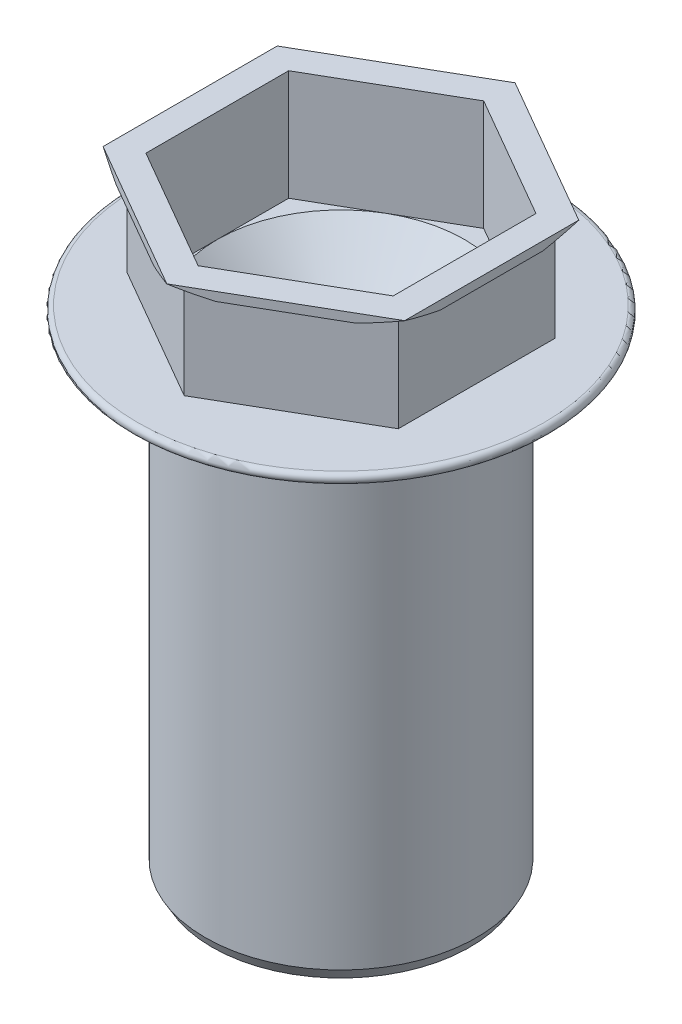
ISO-10303-21;
HEADER;
FILE_DESCRIPTION(('STEP AP214'),'2;1');
FILE_NAME('part.step','',(''),(''),'','','');
FILE_SCHEMA(('AUTOMOTIVE_DESIGN { 1 0 10303 214 1 1 1 1 }'));
ENDSEC;
DATA;
#1=APPLICATION_CONTEXT('core data for automotive mechanical design processes');
#2=APPLICATION_PROTOCOL_DEFINITION('international standard','automotive_design',2000,#1);
#3=PRODUCT_CONTEXT('',#1,'mechanical');
#4=PRODUCT('Part','Part','',(#3));
#5=PRODUCT_RELATED_PRODUCT_CATEGORY('part','',(#4));
#6=PRODUCT_DEFINITION_FORMATION('','',#4);
#7=PRODUCT_DEFINITION_CONTEXT('part definition',#1,'design');
#8=PRODUCT_DEFINITION('design','',#6,#7);
#9=PRODUCT_DEFINITION_SHAPE('','',#8);
#10=(LENGTH_UNIT() NAMED_UNIT(*) SI_UNIT(.MILLI.,.METRE.));
#11=(NAMED_UNIT(*) PLANE_ANGLE_UNIT() SI_UNIT($,.RADIAN.));
#12=(NAMED_UNIT(*) SI_UNIT($,.STERADIAN.) SOLID_ANGLE_UNIT());
#13=UNCERTAINTY_MEASURE_WITH_UNIT(LENGTH_MEASURE(1.E-05),#10,'distance_accuracy_value','');
#14=(GEOMETRIC_REPRESENTATION_CONTEXT(3) GLOBAL_UNCERTAINTY_ASSIGNED_CONTEXT((#13)) GLOBAL_UNIT_ASSIGNED_CONTEXT((#10,
#11,#12)) REPRESENTATION_CONTEXT('',''));
#15=CARTESIAN_POINT('',(0.,0.,0.));
#16=DIRECTION('',(0.,0.,1.));
#17=DIRECTION('',(1.,0.,0.));
#18=AXIS2_PLACEMENT_3D('',#15,#16,#17);
#19=CARTESIAN_POINT('',(0.,6.30000000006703,0.));
#20=DIRECTION('',(0.,1.,0.));
#21=DIRECTION('',(0.,0.,1.));
#22=AXIS2_PLACEMENT_3D('',#19,#20,#21);
#23=CONICAL_SURFACE('',#22,2.45875000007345,1.0471975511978);
#24=CARTESIAN_POINT('',(0.,6.3,0.));
#25=DIRECTION('',(0.,-1.,0.));
#26=DIRECTION('',(1.,0.,0.));
#27=AXIS2_PLACEMENT_3D('',#24,#25,#26);
#28=CIRCLE('',#27,2.45875);
#29=CARTESIAN_POINT('',(2.45875,6.3,0.));
#30=VERTEX_POINT('',#29);
#31=EDGE_CURVE('E244',#30,#30,#28,.F.);
#32=ORIENTED_EDGE('',*,*,#31,.T.);
#33=EDGE_LOOP('',(#32));
#34=FACE_BOUND('',#33,.T.);
#35=CARTESIAN_POINT('',(0.,4.88044002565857,0.));
#36=VERTEX_POINT('',#35);
#37=VERTEX_LOOP('',#36);
#38=FACE_BOUND('',#37,.T.);
#39=ADVANCED_FACE('F16',(#34,#38),#23,.F.);
#40=CARTESIAN_POINT('',(0.,7.079375,0.));
#41=DIRECTION('',(0.,-1.,0.));
#42=DIRECTION('',(1.,0.,0.));
#43=AXIS2_PLACEMENT_3D('',#40,#41,#42);
#44=CYLINDRICAL_SURFACE('',#43,2.45875);
#45=ORIENTED_EDGE('',*,*,#31,.F.);
#46=EDGE_LOOP('',(#45));
#47=FACE_BOUND('',#46,.T.);
#48=CARTESIAN_POINT('',(0.,7.8587499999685,0.));
#49=DIRECTION('',(0.,1.,0.));
#50=DIRECTION('',(1.,0.,0.));
#51=AXIS2_PLACEMENT_3D('',#48,#49,#50);
#52=CIRCLE('',#51,2.45875000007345);
#53=CARTESIAN_POINT('',(2.45875000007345,7.8587499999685,0.));
#54=VERTEX_POINT('',#53);
#55=EDGE_CURVE('E240',#54,#54,#52,.T.);
#56=ORIENTED_EDGE('',*,*,#55,.T.);
#57=EDGE_LOOP('',(#56));
#58=FACE_BOUND('',#57,.T.);
#59=ADVANCED_FACE('F913',(#47,#58),#44,.F.);
#60=CARTESIAN_POINT('',(0.,8.39999999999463,0.));
#61=DIRECTION('',(0.,1.,0.));
#62=DIRECTION('',(0.,0.,1.));
#63=AXIS2_PLACEMENT_3D('',#60,#61,#62);
#64=CONICAL_SURFACE('',#63,3.00000000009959,0.785398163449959);
#65=ORIENTED_EDGE('',*,*,#55,.F.);
#66=EDGE_LOOP('',(#65));
#67=FACE_BOUND('',#66,.T.);
#68=CARTESIAN_POINT('',(0.,8.39999999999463,0.));
#69=DIRECTION('',(0.,1.,0.));
#70=DIRECTION('',(0.,0.,1.));
#71=AXIS2_PLACEMENT_3D('',#68,#69,#70);
#72=CIRCLE('',#71,3.00000000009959);
#73=CARTESIAN_POINT('',(0.,8.39999999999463,3.00000000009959));
#74=VERTEX_POINT('',#73);
#75=EDGE_CURVE('E243',#74,#74,#72,.T.);
#76=ORIENTED_EDGE('',*,*,#75,.T.);
#77=EDGE_LOOP('',(#76));
#78=FACE_BOUND('',#77,.T.);
#79=ADVANCED_FACE('F905',(#67,#78),#64,.F.);
#80=CARTESIAN_POINT('',(2.729375,8.4,0.));
#81=DIRECTION('',(0.,1.,0.));
#82=DIRECTION('',(-1.,0.,0.));
#83=AXIS2_PLACEMENT_3D('',#80,#81,#82);
#84=PLANE('',#83);
#85=CARTESIAN_POINT('',(0.,8.4,0.));
#86=DIRECTION('',(0.,-1.,0.));
#87=DIRECTION('',(1.,0.,0.));
#88=AXIS2_PLACEMENT_3D('',#85,#86,#87);
#89=CIRCLE('',#88,2.45875);
#90=CARTESIAN_POINT('',(2.45875,8.4,0.));
#91=VERTEX_POINT('',#90);
#92=EDGE_CURVE('E239',#91,#91,#89,.F.);
#93=ORIENTED_EDGE('',*,*,#92,.T.);
#94=EDGE_LOOP('',(#93));
#95=FACE_BOUND('',#94,.T.);
#96=ORIENTED_EDGE('',*,*,#75,.F.);
#97=EDGE_LOOP('',(#96));
#98=FACE_BOUND('',#97,.T.);
#99=ADVANCED_FACE('F897',(#95,#98),#84,.F.);
#100=CARTESIAN_POINT('',(0.,14.879375,0.));
#101=DIRECTION('',(0.,-1.,0.));
#102=DIRECTION('',(1.,0.,0.));
#103=AXIS2_PLACEMENT_3D('',#100,#101,#102);
#104=CYLINDRICAL_SURFACE('',#103,2.45875);
#105=ORIENTED_EDGE('',*,*,#92,.F.);
#106=EDGE_LOOP('',(#105));
#107=FACE_BOUND('',#106,.T.);
#108=CARTESIAN_POINT('',(0.,14.5512635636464,0.));
#109=DIRECTION('',(0.,1.,0.));
#110=DIRECTION('',(1.,0.,0.));
#111=AXIS2_PLACEMENT_3D('',#108,#109,#110);
#112=CIRCLE('',#111,2.45874999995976);
#113=CARTESIAN_POINT('',(2.45874999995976,14.5512635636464,0.));
#114=VERTEX_POINT('',#113);
#115=EDGE_CURVE('E216',#114,#114,#112,.T.);
#116=ORIENTED_EDGE('',*,*,#115,.T.);
#117=EDGE_LOOP('',(#116));
#118=FACE_BOUND('',#117,.T.);
#119=ADVANCED_FACE('F889',(#107,#118),#104,.F.);
#120=CARTESIAN_POINT('',(0.,16.1375000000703,0.));
#121=DIRECTION('',(0.,1.,0.));
#122=DIRECTION('',(0.,0.,1.));
#123=AXIS2_PLACEMENT_3D('',#120,#121,#122);
#124=CONICAL_SURFACE('',#123,4.10000000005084,0.802441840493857);
#125=ORIENTED_EDGE('',*,*,#115,.F.);
#126=EDGE_LOOP('',(#125));
#127=FACE_BOUND('',#126,.T.);
#128=CARTESIAN_POINT('',(0.,16.1375000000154,0.));
#129=DIRECTION('',(0.,1.,0.));
#130=DIRECTION('',(0.,0.,1.));
#131=AXIS2_PLACEMENT_3D('',#128,#129,#130);
#132=CIRCLE('',#131,4.099999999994);
#133=CARTESIAN_POINT('',(-4.10000000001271,16.1375000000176,0.));
#134=VERTEX_POINT('',#133);
#135=CARTESIAN_POINT('',(-2.0499999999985,16.1375000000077,-3.5507041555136));
#136=VERTEX_POINT('',#135);
#137=EDGE_CURVE('E189',#134,#136,#132,.F.);
#138=ORIENTED_EDGE('',*,*,#137,.F.);
#139=CARTESIAN_POINT('',(0.,16.1375000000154,0.));
#140=DIRECTION('',(0.,1.,0.));
#141=DIRECTION('',(0.,0.,1.));
#142=AXIS2_PLACEMENT_3D('',#139,#140,#141);
#143=CIRCLE('',#142,4.099999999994);
#144=CARTESIAN_POINT('',(-2.0499999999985,16.1375000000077,3.5507041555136));
#145=VERTEX_POINT('',#144);
#146=EDGE_CURVE('E317',#145,#134,#143,.F.);
#147=ORIENTED_EDGE('',*,*,#146,.F.);
#148=CARTESIAN_POINT('',(0.,16.1375000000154,0.));
#149=DIRECTION('',(0.,1.,0.));
#150=DIRECTION('',(0.,0.,1.));
#151=AXIS2_PLACEMENT_3D('',#148,#149,#150);
#152=CIRCLE('',#151,4.099999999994);
#153=CARTESIAN_POINT('',(2.0499999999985,16.1375000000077,3.5507041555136));
#154=VERTEX_POINT('',#153);
#155=EDGE_CURVE('E232',#154,#145,#152,.F.);
#156=ORIENTED_EDGE('',*,*,#155,.F.);
#157=CARTESIAN_POINT('',(0.,16.1375000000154,0.));
#158=DIRECTION('',(0.,1.,0.));
#159=DIRECTION('',(0.,0.,1.));
#160=AXIS2_PLACEMENT_3D('',#157,#158,#159);
#161=CIRCLE('',#160,4.099999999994);
#162=CARTESIAN_POINT('',(4.10000000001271,16.1375000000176,0.));
#163=VERTEX_POINT('',#162);
#164=EDGE_CURVE('E319',#163,#154,#161,.F.);
#165=ORIENTED_EDGE('',*,*,#164,.F.);
#166=CARTESIAN_POINT('',(0.,16.1375000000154,0.));
#167=DIRECTION('',(0.,1.,0.));
#168=DIRECTION('',(0.,0.,1.));
#169=AXIS2_PLACEMENT_3D('',#166,#167,#168);
#170=CIRCLE('',#169,4.099999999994);
#171=CARTESIAN_POINT('',(2.0499999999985,16.1375000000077,-3.5507041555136));
#172=VERTEX_POINT('',#171);
#173=EDGE_CURVE('E196',#172,#163,#170,.F.);
#174=ORIENTED_EDGE('',*,*,#173,.F.);
#175=CARTESIAN_POINT('',(0.,16.1375000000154,0.));
#176=DIRECTION('',(0.,1.,0.));
#177=DIRECTION('',(0.,0.,1.));
#178=AXIS2_PLACEMENT_3D('',#175,#176,#177);
#179=CIRCLE('',#178,4.099999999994);
#180=EDGE_CURVE('E192',#136,#172,#179,.F.);
#181=ORIENTED_EDGE('',*,*,#180,.F.);
#182=EDGE_LOOP('',(#138,#147,#156,#165,#174,#181));
#183=FACE_BOUND('',#182,.T.);
#184=ADVANCED_FACE('F194',(#127,#183),#124,.F.);
#185=CARTESIAN_POINT('',(0.,16.1375,0.));
#186=DIRECTION('',(0.,1.,0.));
#187=DIRECTION('',(0.,0.,1.));
#188=AXIS2_PLACEMENT_3D('',#185,#186,#187);
#189=PLANE('',#188);
#190=DIRECTION('',(-0.866025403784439,0.,0.5));
#191=VECTOR('',#190,1.);
#192=CARTESIAN_POINT('',(-2.05,16.1375,-3.5507041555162));
#193=LINE('',#192,#191);
#194=CARTESIAN_POINT('',(-4.1,16.1375,-2.36713610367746));
#195=VERTEX_POINT('',#194);
#196=EDGE_CURVE('E208',#136,#195,#193,.T.);
#197=ORIENTED_EDGE('',*,*,#196,.T.);
#198=DIRECTION('',(0.,0.,1.));
#199=VECTOR('',#198,1.);
#200=CARTESIAN_POINT('',(-4.1,16.1375,0.));
#201=LINE('',#200,#199);
#202=EDGE_CURVE('E214',#195,#134,#201,.T.);
#203=ORIENTED_EDGE('',*,*,#202,.T.);
#204=ORIENTED_EDGE('',*,*,#137,.T.);
#205=EDGE_LOOP('',(#197,#203,#204));
#206=FACE_BOUND('',#205,.T.);
#207=ADVANCED_FACE('F212',(#206),#189,.T.);
#208=CARTESIAN_POINT('',(0.,16.1375,0.));
#209=DIRECTION('',(0.,1.,0.));
#210=DIRECTION('',(0.,0.,1.));
#211=AXIS2_PLACEMENT_3D('',#208,#209,#210);
#212=PLANE('',#211);
#213=DIRECTION('',(-0.866025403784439,0.,-0.5));
#214=VECTOR('',#213,1.);
#215=CARTESIAN_POINT('',(2.05,16.1375,-3.5507041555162));
#216=LINE('',#215,#214);
#217=CARTESIAN_POINT('',(0.,16.1375,-4.73427220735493));
#218=VERTEX_POINT('',#217);
#219=EDGE_CURVE('E204',#172,#218,#216,.T.);
#220=ORIENTED_EDGE('',*,*,#219,.T.);
#221=DIRECTION('',(-0.866025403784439,0.,0.5));
#222=VECTOR('',#221,1.);
#223=CARTESIAN_POINT('',(-2.05,16.1375,-3.5507041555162));
#224=LINE('',#223,#222);
#225=EDGE_CURVE('E202',#218,#136,#224,.T.);
#226=ORIENTED_EDGE('',*,*,#225,.T.);
#227=ORIENTED_EDGE('',*,*,#180,.T.);
#228=EDGE_LOOP('',(#220,#226,#227));
#229=FACE_BOUND('',#228,.T.);
#230=ADVANCED_FACE('F203',(#229),#212,.T.);
#231=CARTESIAN_POINT('',(0.,16.1375,0.));
#232=DIRECTION('',(0.,1.,0.));
#233=DIRECTION('',(0.,0.,1.));
#234=AXIS2_PLACEMENT_3D('',#231,#232,#233);
#235=PLANE('',#234);
#236=DIRECTION('',(0.,0.,-1.));
#237=VECTOR('',#236,1.);
#238=CARTESIAN_POINT('',(4.1,16.1375,0.));
#239=LINE('',#238,#237);
#240=CARTESIAN_POINT('',(4.1,16.1375,-2.36713610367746));
#241=VERTEX_POINT('',#240);
#242=EDGE_CURVE('E565',#163,#241,#239,.T.);
#243=ORIENTED_EDGE('',*,*,#242,.T.);
#244=DIRECTION('',(-0.866025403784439,0.,-0.5));
#245=VECTOR('',#244,1.);
#246=CARTESIAN_POINT('',(2.05,16.1375,-3.5507041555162));
#247=LINE('',#246,#245);
#248=EDGE_CURVE('E223',#241,#172,#247,.T.);
#249=ORIENTED_EDGE('',*,*,#248,.T.);
#250=ORIENTED_EDGE('',*,*,#173,.T.);
#251=EDGE_LOOP('',(#243,#249,#250));
#252=FACE_BOUND('',#251,.T.);
#253=ADVANCED_FACE('F615',(#252),#235,.T.);
#254=CARTESIAN_POINT('',(0.,16.1375,0.));
#255=DIRECTION('',(0.,1.,0.));
#256=DIRECTION('',(0.,0.,1.));
#257=AXIS2_PLACEMENT_3D('',#254,#255,#256);
#258=PLANE('',#257);
#259=DIRECTION('',(0.866025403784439,0.,-0.5));
#260=VECTOR('',#259,1.);
#261=CARTESIAN_POINT('',(2.05,16.1375,3.5507041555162));
#262=LINE('',#261,#260);
#263=CARTESIAN_POINT('',(4.1,16.1375,2.36713610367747));
#264=VERTEX_POINT('',#263);
#265=EDGE_CURVE('E536',#154,#264,#262,.T.);
#266=ORIENTED_EDGE('',*,*,#265,.T.);
#267=DIRECTION('',(0.,0.,-1.));
#268=VECTOR('',#267,1.);
#269=CARTESIAN_POINT('',(4.1,16.1375,0.));
#270=LINE('',#269,#268);
#271=EDGE_CURVE('E562',#264,#163,#270,.T.);
#272=ORIENTED_EDGE('',*,*,#271,.T.);
#273=ORIENTED_EDGE('',*,*,#164,.T.);
#274=EDGE_LOOP('',(#266,#272,#273));
#275=FACE_BOUND('',#274,.T.);
#276=ADVANCED_FACE('F610',(#275),#258,.T.);
#277=CARTESIAN_POINT('',(0.,16.1375,0.));
#278=DIRECTION('',(0.,1.,0.));
#279=DIRECTION('',(0.,0.,1.));
#280=AXIS2_PLACEMENT_3D('',#277,#278,#279);
#281=PLANE('',#280);
#282=DIRECTION('',(0.,0.,1.));
#283=VECTOR('',#282,1.);
#284=CARTESIAN_POINT('',(-4.1,16.1375,0.));
#285=LINE('',#284,#283);
#286=CARTESIAN_POINT('',(-4.1,16.1375,2.36713610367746));
#287=VERTEX_POINT('',#286);
#288=EDGE_CURVE('E209',#134,#287,#285,.T.);
#289=ORIENTED_EDGE('',*,*,#288,.T.);
#290=DIRECTION('',(0.866025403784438,0.,0.5));
#291=VECTOR('',#290,1.);
#292=CARTESIAN_POINT('',(-2.05,16.1375,3.5507041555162));
#293=LINE('',#292,#291);
#294=EDGE_CURVE('E522',#287,#145,#293,.T.);
#295=ORIENTED_EDGE('',*,*,#294,.T.);
#296=ORIENTED_EDGE('',*,*,#146,.T.);
#297=EDGE_LOOP('',(#289,#295,#296));
#298=FACE_BOUND('',#297,.T.);
#299=ADVANCED_FACE('F603',(#298),#281,.T.);
#300=CARTESIAN_POINT('',(0.,16.1375,0.));
#301=DIRECTION('',(0.,1.,0.));
#302=DIRECTION('',(0.,0.,1.));
#303=AXIS2_PLACEMENT_3D('',#300,#301,#302);
#304=PLANE('',#303);
#305=DIRECTION('',(0.866025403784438,0.,0.5));
#306=VECTOR('',#305,1.);
#307=CARTESIAN_POINT('',(-2.05,16.1375,3.5507041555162));
#308=LINE('',#307,#306);
#309=CARTESIAN_POINT('',(0.,16.1375,4.73427220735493));
#310=VERTEX_POINT('',#309);
#311=EDGE_CURVE('E525',#145,#310,#308,.T.);
#312=ORIENTED_EDGE('',*,*,#311,.T.);
#313=DIRECTION('',(0.866025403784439,0.,-0.5));
#314=VECTOR('',#313,1.);
#315=CARTESIAN_POINT('',(2.05,16.1375,3.5507041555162));
#316=LINE('',#315,#314);
#317=EDGE_CURVE('E533',#310,#154,#316,.T.);
#318=ORIENTED_EDGE('',*,*,#317,.T.);
#319=ORIENTED_EDGE('',*,*,#155,.T.);
#320=EDGE_LOOP('',(#312,#318,#319));
#321=FACE_BOUND('',#320,.T.);
#322=ADVANCED_FACE('F605',(#321),#304,.T.);
#323=CARTESIAN_POINT('',(-4.1,20.8,0.));
#324=DIRECTION('',(-1.,0.,0.));
#325=DIRECTION('',(0.,0.,1.));
#326=AXIS2_PLACEMENT_3D('',#323,#324,#325);
#327=PLANE('',#326);
#328=DIRECTION('',(0.,1.,0.));
#329=VECTOR('',#328,1.);
#330=CARTESIAN_POINT('',(-4.1,20.8,2.36713610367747));
#331=LINE('',#330,#329);
#332=CARTESIAN_POINT('',(-4.1,19.8,2.36713610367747));
#333=VERTEX_POINT('',#332);
#334=EDGE_CURVE('E526',#333,#287,#331,.F.);
#335=ORIENTED_EDGE('',*,*,#334,.T.);
#336=ORIENTED_EDGE('',*,*,#288,.F.);
#337=ORIENTED_EDGE('',*,*,#202,.F.);
#338=DIRECTION('',(0.,1.,0.));
#339=VECTOR('',#338,1.);
#340=CARTESIAN_POINT('',(-4.1,20.8,-2.36713610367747));
#341=LINE('',#340,#339);
#342=CARTESIAN_POINT('',(-4.1,19.8,-2.36713610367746));
#343=VERTEX_POINT('',#342);
#344=EDGE_CURVE('E221',#195,#343,#341,.T.);
#345=ORIENTED_EDGE('',*,*,#344,.T.);
#346=DIRECTION('',(0.,0.,1.));
#347=VECTOR('',#346,1.);
#348=CARTESIAN_POINT('',(-4.1,19.8,0.));
#349=LINE('',#348,#347);
#350=EDGE_CURVE('E504',#333,#343,#349,.F.);
#351=ORIENTED_EDGE('',*,*,#350,.F.);
#352=EDGE_LOOP('',(#335,#336,#337,#345,#351));
#353=FACE_BOUND('',#352,.T.);
#354=ADVANCED_FACE('F595',(#353),#327,.F.);
#355=CARTESIAN_POINT('',(-2.05,20.8,-3.5507041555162));
#356=DIRECTION('',(-0.5,0.,-0.866025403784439));
#357=DIRECTION('',(-0.866025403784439,0.,0.5));
#358=AXIS2_PLACEMENT_3D('',#355,#356,#357);
#359=PLANE('',#358);
#360=ORIENTED_EDGE('',*,*,#344,.F.);
#361=ORIENTED_EDGE('',*,*,#196,.F.);
#362=ORIENTED_EDGE('',*,*,#225,.F.);
#363=DIRECTION('',(0.,1.,0.));
#364=VECTOR('',#363,1.);
#365=CARTESIAN_POINT('',(0.,20.8,-4.73427220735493));
#366=LINE('',#365,#364);
#367=CARTESIAN_POINT('',(0.,19.8,-4.73427220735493));
#368=VERTEX_POINT('',#367);
#369=EDGE_CURVE('E566',#218,#368,#366,.T.);
#370=ORIENTED_EDGE('',*,*,#369,.T.);
#371=DIRECTION('',(0.866025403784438,0.,-0.500000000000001));
#372=VECTOR('',#371,1.);
#373=CARTESIAN_POINT('',(-4.1,19.8,-2.36713610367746));
#374=LINE('',#373,#372);
#375=EDGE_CURVE('E501',#343,#368,#374,.T.);
#376=ORIENTED_EDGE('',*,*,#375,.F.);
#377=EDGE_LOOP('',(#360,#361,#362,#370,#376));
#378=FACE_BOUND('',#377,.T.);
#379=ADVANCED_FACE('F219',(#378),#359,.F.);
#380=CARTESIAN_POINT('',(2.05,20.8,-3.5507041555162));
#381=DIRECTION('',(0.5,0.,-0.866025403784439));
#382=DIRECTION('',(-0.866025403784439,0.,-0.5));
#383=AXIS2_PLACEMENT_3D('',#380,#381,#382);
#384=PLANE('',#383);
#385=ORIENTED_EDGE('',*,*,#369,.F.);
#386=ORIENTED_EDGE('',*,*,#219,.F.);
#387=ORIENTED_EDGE('',*,*,#248,.F.);
#388=DIRECTION('',(0.,1.,0.));
#389=VECTOR('',#388,1.);
#390=CARTESIAN_POINT('',(4.1,20.8,-2.36713610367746));
#391=LINE('',#390,#389);
#392=CARTESIAN_POINT('',(4.1,19.8,-2.36713610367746));
#393=VERTEX_POINT('',#392);
#394=EDGE_CURVE('E537',#241,#393,#391,.T.);
#395=ORIENTED_EDGE('',*,*,#394,.T.);
#396=DIRECTION('',(0.866025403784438,0.,0.500000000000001));
#397=VECTOR('',#396,1.);
#398=CARTESIAN_POINT('',(0.,19.8,-4.73427220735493));
#399=LINE('',#398,#397);
#400=EDGE_CURVE('E498',#368,#393,#399,.T.);
#401=ORIENTED_EDGE('',*,*,#400,.F.);
#402=EDGE_LOOP('',(#385,#386,#387,#395,#401));
#403=FACE_BOUND('',#402,.T.);
#404=ADVANCED_FACE('F587',(#403),#384,.F.);
#405=CARTESIAN_POINT('',(4.1,20.8,0.));
#406=DIRECTION('',(1.,0.,0.));
#407=DIRECTION('',(0.,0.,-1.));
#408=AXIS2_PLACEMENT_3D('',#405,#406,#407);
#409=PLANE('',#408);
#410=ORIENTED_EDGE('',*,*,#394,.F.);
#411=ORIENTED_EDGE('',*,*,#242,.F.);
#412=ORIENTED_EDGE('',*,*,#271,.F.);
#413=DIRECTION('',(0.,1.,0.));
#414=VECTOR('',#413,1.);
#415=CARTESIAN_POINT('',(4.1,20.8,2.36713610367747));
#416=LINE('',#415,#414);
#417=CARTESIAN_POINT('',(4.1,19.8,2.36713610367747));
#418=VERTEX_POINT('',#417);
#419=EDGE_CURVE('E545',#264,#418,#416,.T.);
#420=ORIENTED_EDGE('',*,*,#419,.T.);
#421=DIRECTION('',(0.,0.,1.));
#422=VECTOR('',#421,1.);
#423=CARTESIAN_POINT('',(4.1,19.8,0.));
#424=LINE('',#423,#422);
#425=EDGE_CURVE('E495',#393,#418,#424,.T.);
#426=ORIENTED_EDGE('',*,*,#425,.F.);
#427=EDGE_LOOP('',(#410,#411,#412,#420,#426));
#428=FACE_BOUND('',#427,.T.);
#429=ADVANCED_FACE('F616',(#428),#409,.F.);
#430=CARTESIAN_POINT('',(2.05,20.8,3.5507041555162));
#431=DIRECTION('',(0.5,0.,0.866025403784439));
#432=DIRECTION('',(0.866025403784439,0.,-0.5));
#433=AXIS2_PLACEMENT_3D('',#430,#431,#432);
#434=PLANE('',#433);
#435=ORIENTED_EDGE('',*,*,#419,.F.);
#436=ORIENTED_EDGE('',*,*,#265,.F.);
#437=ORIENTED_EDGE('',*,*,#317,.F.);
#438=DIRECTION('',(0.,1.,0.));
#439=VECTOR('',#438,1.);
#440=CARTESIAN_POINT('',(0.,20.8,4.73427220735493));
#441=LINE('',#440,#439);
#442=CARTESIAN_POINT('',(0.,19.8,4.73427220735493));
#443=VERTEX_POINT('',#442);
#444=EDGE_CURVE('E530',#310,#443,#441,.T.);
#445=ORIENTED_EDGE('',*,*,#444,.T.);
#446=DIRECTION('',(-0.866025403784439,0.,0.499999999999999));
#447=VECTOR('',#446,1.);
#448=CARTESIAN_POINT('',(4.1,19.8,2.36713610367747));
#449=LINE('',#448,#447);
#450=EDGE_CURVE('E491',#418,#443,#449,.T.);
#451=ORIENTED_EDGE('',*,*,#450,.F.);
#452=EDGE_LOOP('',(#435,#436,#437,#445,#451));
#453=FACE_BOUND('',#452,.T.);
#454=ADVANCED_FACE('F619',(#453),#434,.F.);
#455=CARTESIAN_POINT('',(-2.05,20.8,3.5507041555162));
#456=DIRECTION('',(-0.5,0.,0.866025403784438));
#457=DIRECTION('',(0.866025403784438,0.,0.5));
#458=AXIS2_PLACEMENT_3D('',#455,#456,#457);
#459=PLANE('',#458);
#460=ORIENTED_EDGE('',*,*,#444,.F.);
#461=ORIENTED_EDGE('',*,*,#311,.F.);
#462=ORIENTED_EDGE('',*,*,#294,.F.);
#463=ORIENTED_EDGE('',*,*,#334,.F.);
#464=DIRECTION('',(-0.866025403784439,0.,-0.499999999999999));
#465=VECTOR('',#464,1.);
#466=CARTESIAN_POINT('',(0.,19.8,4.73427220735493));
#467=LINE('',#466,#465);
#468=EDGE_CURVE('E494',#443,#333,#467,.T.);
#469=ORIENTED_EDGE('',*,*,#468,.F.);
#470=EDGE_LOOP('',(#460,#461,#462,#463,#469));
#471=FACE_BOUND('',#470,.T.);
#472=ADVANCED_FACE('F600',(#471),#459,.F.);
#473=CARTESIAN_POINT('',(2.89,19.8,0.));
#474=DIRECTION('',(0.,1.,0.));
#475=DIRECTION('',(0.,0.,1.));
#476=AXIS2_PLACEMENT_3D('',#473,#474,#475);
#477=PLANE('',#476);
#478=DIRECTION('',(0.866025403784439,0.,-0.5));
#479=VECTOR('',#478,1.);
#480=CARTESIAN_POINT('',(2.5,19.8,4.3301270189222));
#481=LINE('',#480,#479);
#482=CARTESIAN_POINT('',(5.,19.8,2.88675134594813));
#483=VERTEX_POINT('',#482);
#484=CARTESIAN_POINT('',(0.,19.8,5.77350269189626));
#485=VERTEX_POINT('',#484);
#486=EDGE_CURVE('E472',#483,#485,#481,.F.);
#487=ORIENTED_EDGE('',*,*,#486,.F.);
#488=DIRECTION('',(0.,0.,-1.));
#489=VECTOR('',#488,1.);
#490=CARTESIAN_POINT('',(5.,19.8,0.));
#491=LINE('',#490,#489);
#492=CARTESIAN_POINT('',(5.,19.8,-2.88675134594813));
#493=VERTEX_POINT('',#492);
#494=EDGE_CURVE('E465',#493,#483,#491,.F.);
#495=ORIENTED_EDGE('',*,*,#494,.F.);
#496=DIRECTION('',(-0.866025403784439,0.,-0.5));
#497=VECTOR('',#496,1.);
#498=CARTESIAN_POINT('',(2.5,19.8,-4.33012701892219));
#499=LINE('',#498,#497);
#500=CARTESIAN_POINT('',(0.,19.8,-5.77350269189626));
#501=VERTEX_POINT('',#500);
#502=EDGE_CURVE('E458',#501,#493,#499,.F.);
#503=ORIENTED_EDGE('',*,*,#502,.F.);
#504=DIRECTION('',(-0.866025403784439,0.,0.5));
#505=VECTOR('',#504,1.);
#506=CARTESIAN_POINT('',(-2.5,19.8,-4.33012701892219));
#507=LINE('',#506,#505);
#508=CARTESIAN_POINT('',(-5.,19.8,-2.88675134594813));
#509=VERTEX_POINT('',#508);
#510=EDGE_CURVE('E447',#509,#501,#507,.F.);
#511=ORIENTED_EDGE('',*,*,#510,.F.);
#512=DIRECTION('',(0.,0.,1.));
#513=VECTOR('',#512,1.);
#514=CARTESIAN_POINT('',(-5.,19.8,0.));
#515=LINE('',#514,#513);
#516=CARTESIAN_POINT('',(-5.,19.8,2.88675134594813));
#517=VERTEX_POINT('',#516);
#518=EDGE_CURVE('E310',#517,#509,#515,.F.);
#519=ORIENTED_EDGE('',*,*,#518,.F.);
#520=DIRECTION('',(0.866025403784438,0.,0.5));
#521=VECTOR('',#520,1.);
#522=CARTESIAN_POINT('',(-2.5,19.8,4.33012701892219));
#523=LINE('',#522,#521);
#524=EDGE_CURVE('E479',#485,#517,#523,.F.);
#525=ORIENTED_EDGE('',*,*,#524,.F.);
#526=EDGE_LOOP('',(#487,#495,#503,#511,#519,#525));
#527=FACE_BOUND('',#526,.T.);
#528=ORIENTED_EDGE('',*,*,#450,.T.);
#529=ORIENTED_EDGE('',*,*,#468,.T.);
#530=ORIENTED_EDGE('',*,*,#350,.T.);
#531=ORIENTED_EDGE('',*,*,#375,.T.);
#532=ORIENTED_EDGE('',*,*,#400,.T.);
#533=ORIENTED_EDGE('',*,*,#425,.T.);
#534=EDGE_LOOP('',(#528,#529,#530,#531,#532,#533));
#535=FACE_BOUND('',#534,.T.);
#536=ADVANCED_FACE('F295',(#527,#535),#477,.T.);
#537=CARTESIAN_POINT('',(0.,19.7979583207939,0.));
#538=DIRECTION('',(0.,1.,0.));
#539=DIRECTION('',(0.,0.,1.));
#540=AXIS2_PLACEMENT_3D('',#537,#538,#539);
#541=CONICAL_SURFACE('',#540,5.77646370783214,1.04719755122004);
#542=CARTESIAN_POINT('',(-5.00000000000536,19.7962487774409,-2.88675134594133));
#543=CARTESIAN_POINT('',(-5.00000000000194,19.767947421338,-2.78870748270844));
#544=CARTESIAN_POINT('',(-5.00000000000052,19.7406402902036,-2.6903717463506));
#545=CARTESIAN_POINT('',(-4.99999999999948,19.6882450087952,-2.49317433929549));
#546=CARTESIAN_POINT('',(-4.99999999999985,19.6631555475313,-2.39431301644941));
#547=CARTESIAN_POINT('',(-5.00000000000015,19.6153900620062,-2.1959977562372));
#548=CARTESIAN_POINT('',(-5.00000000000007,19.5927142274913,-2.09654377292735));
#549=CARTESIAN_POINT('',(-4.99999999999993,19.5499886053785,-1.89701233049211));
#550=CARTESIAN_POINT('',(-4.99999999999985,19.5299403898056,-1.79693453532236));
#551=CARTESIAN_POINT('',(-5.,19.5113248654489,-1.69658480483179));
#552=B_SPLINE_CURVE_WITH_KNOTS('',3,(#542,#543,#544,#545,#546,#547,#548,#549,#550,#551),
.UNSPECIFIED.,.F.,.F.,(4,2,2,2,4),(0.,0.306142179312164,0.612102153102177,0.918086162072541,
1.22425240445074),.UNSPECIFIED.);
#553=CARTESIAN_POINT('',(-5.,19.7962487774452,-2.88675134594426));
#554=VERTEX_POINT('',#553);
#555=CARTESIAN_POINT('',(-5.,19.5113248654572,-1.69658480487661));
#556=VERTEX_POINT('',#555);
#557=EDGE_CURVE('E302',#554,#556,#552,.T.);
#558=ORIENTED_EDGE('',*,*,#557,.F.);
#559=CARTESIAN_POINT('',(-3.969285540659,19.5113248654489,-3.48183461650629));
#560=CARTESIAN_POINT('',(-4.0561909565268,19.5299403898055,-3.43165975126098));
#561=CARTESIAN_POINT('',(-4.14286086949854,19.5499886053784,-3.38162085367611));
#562=CARTESIAN_POINT('',(-4.31566016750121,19.5927142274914,-3.28185513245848));
#563=CARTESIAN_POINT('',(-4.40178984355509,19.6153900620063,-3.23212814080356));
#564=CARTESIAN_POINT('',(-4.57353589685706,19.6631555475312,-3.13297051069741));
#565=CARTESIAN_POINT('',(-4.65915231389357,19.6882450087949,-3.08353984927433));
#566=CARTESIAN_POINT('',(-4.82993027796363,19.740640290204,-2.98494114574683));
#567=CARTESIAN_POINT('',(-4.9150915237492,19.7679474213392,-2.93577327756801));
#568=CARTESIAN_POINT('',(-4.99999999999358,19.7962487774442,-2.88675134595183));
#569=B_SPLINE_CURVE_WITH_KNOTS('',3,(#559,#560,#561,#562,#563,#564,#565,#566,#567,#568),
.UNSPECIFIED.,.F.,.F.,(4,2,2,2,4),(0.,0.306166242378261,0.612150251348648,0.918110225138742,
1.22425240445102),.UNSPECIFIED.);
#570=CARTESIAN_POINT('',(-3.96928554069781,19.5113248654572,-3.48183461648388));
#571=VERTEX_POINT('',#570);
#572=EDGE_CURVE('E271',#571,#554,#569,.T.);
#573=ORIENTED_EDGE('',*,*,#572,.F.);
#574=CARTESIAN_POINT('',(0.,19.5113248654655,0.));
#575=DIRECTION('',(0.,1.,0.));
#576=DIRECTION('',(0.,0.,1.));
#577=AXIS2_PLACEMENT_3D('',#574,#575,#576);
#578=CIRCLE('',#577,5.28000000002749);
#579=EDGE_CURVE('E268',#571,#556,#578,.T.);
#580=ORIENTED_EDGE('',*,*,#579,.T.);
#581=EDGE_LOOP('',(#558,#573,#580));
#582=FACE_BOUND('',#581,.T.);
#583=ADVANCED_FACE('F289',(#582),#541,.T.);
#584=CARTESIAN_POINT('',(-5.,19.5113248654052,0.));
#585=DIRECTION('',(-1.,0.,0.));
#586=DIRECTION('',(0.,0.,1.));
#587=AXIS2_PLACEMENT_3D('',#584,#585,#586);
#588=PLANE('',#587);
#589=ORIENTED_EDGE('',*,*,#557,.T.);
#590=DIRECTION('',(0.,0.,1.));
#591=VECTOR('',#590,1.);
#592=CARTESIAN_POINT('',(-5.,19.5113248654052,0.));
#593=LINE('',#592,#591);
#594=CARTESIAN_POINT('',(-5.,19.5113248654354,1.69658480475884));
#595=VERTEX_POINT('',#594);
#596=EDGE_CURVE('E267',#556,#595,#593,.T.);
#597=ORIENTED_EDGE('',*,*,#596,.T.);
#598=CARTESIAN_POINT('',(-5.00000000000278,19.7962487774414,2.88675134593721));
#599=CARTESIAN_POINT('',(-5.000000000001,19.7679474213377,2.78870748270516));
#600=CARTESIAN_POINT('',(-5.00000000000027,19.7406402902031,2.69037174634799));
#601=CARTESIAN_POINT('',(-4.99999999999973,19.6882450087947,2.49317433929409));
#602=CARTESIAN_POINT('',(-4.99999999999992,19.663155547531,2.39431301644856));
#603=CARTESIAN_POINT('',(-5.00000000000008,19.6153900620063,2.19599775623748));
#604=CARTESIAN_POINT('',(-5.00000000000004,19.5927142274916,2.09654377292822));
#605=CARTESIAN_POINT('',(-4.99999999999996,19.5499886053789,1.89701233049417));
#606=CARTESIAN_POINT('',(-4.99999999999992,19.529940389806,1.79693453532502));
#607=CARTESIAN_POINT('',(-5.,19.5113248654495,1.69658480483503));
#608=B_SPLINE_CURVE_WITH_KNOTS('',3,(#598,#599,#600,#601,#602,#603,#604,#605,#606,#607),
.UNSPECIFIED.,.F.,.F.,(4,2,2,2,4),(0.,0.306142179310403,0.612102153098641,0.918086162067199,
1.22425240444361),.UNSPECIFIED.);
#609=CARTESIAN_POINT('',(-4.99999999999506,19.796248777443,2.88675134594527));
#610=VERTEX_POINT('',#609);
#611=EDGE_CURVE('E309',#610,#595,#608,.T.);
#612=ORIENTED_EDGE('',*,*,#611,.F.);
#613=DIRECTION('',(0.,1.,0.));
#614=VECTOR('',#613,1.);
#615=CARTESIAN_POINT('',(-5.,19.5113248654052,2.88675134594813));
#616=LINE('',#615,#614);
#617=EDGE_CURVE('E475',#517,#610,#616,.F.);
#618=ORIENTED_EDGE('',*,*,#617,.F.);
#619=ORIENTED_EDGE('',*,*,#518,.T.);
#620=DIRECTION('',(0.,1.,0.));
#621=VECTOR('',#620,1.);
#622=CARTESIAN_POINT('',(-5.,19.5113248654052,-2.88675134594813));
#623=LINE('',#622,#621);
#624=EDGE_CURVE('E279',#554,#509,#623,.T.);
#625=ORIENTED_EDGE('',*,*,#624,.F.);
#626=EDGE_LOOP('',(#589,#597,#612,#618,#619,#625));
#627=FACE_BOUND('',#626,.T.);
#628=ADVANCED_FACE('F294',(#627),#588,.T.);
#629=CARTESIAN_POINT('',(0.,19.7979583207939,0.));
#630=DIRECTION('',(0.,1.,0.));
#631=DIRECTION('',(0.,0.,1.));
#632=AXIS2_PLACEMENT_3D('',#629,#630,#631);
#633=CONICAL_SURFACE('',#632,5.77646370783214,1.04719755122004);
#634=CARTESIAN_POINT('',(-4.99999999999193,19.7962487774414,2.886751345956));
#635=CARTESIAN_POINT('',(-4.9150915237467,19.7679474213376,2.93577327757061));
#636=CARTESIAN_POINT('',(-4.82993027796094,19.7406402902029,2.98494114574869));
#637=CARTESIAN_POINT('',(-4.65915231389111,19.6882450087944,3.08353984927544));
#638=CARTESIAN_POINT('',(-4.57353589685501,19.6631555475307,3.13297051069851));
#639=CARTESIAN_POINT('',(-4.40178984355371,19.6153900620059,3.23212814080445));
#640=CARTESIAN_POINT('',(-4.31566016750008,19.5927142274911,3.28185513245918));
#641=CARTESIAN_POINT('',(-4.14286086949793,19.5499886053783,3.38162085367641));
#642=CARTESIAN_POINT('',(-4.05619095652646,19.5299403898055,3.43165975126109));
#643=CARTESIAN_POINT('',(-3.969285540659,19.5113248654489,3.48183461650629));
#644=B_SPLINE_CURVE_WITH_KNOTS('',3,(#634,#635,#636,#637,#638,#639,#640,#641,#642,#643),
.UNSPECIFIED.,.F.,.F.,(4,2,2,2,4),(0.,0.306142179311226,0.612102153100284,0.918086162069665,
1.2242524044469),.UNSPECIFIED.);
#645=CARTESIAN_POINT('',(-3.96928554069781,19.5113248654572,3.48183461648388));
#646=VERTEX_POINT('',#645);
#647=EDGE_CURVE('E478',#610,#646,#644,.T.);
#648=ORIENTED_EDGE('',*,*,#647,.F.);
#649=ORIENTED_EDGE('',*,*,#611,.T.);
#650=CARTESIAN_POINT('',(0.,19.5113248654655,0.));
#651=DIRECTION('',(0.,1.,0.));
#652=DIRECTION('',(0.,0.,1.));
#653=AXIS2_PLACEMENT_3D('',#650,#651,#652);
#654=CIRCLE('',#653,5.28000000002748);
#655=EDGE_CURVE('E265',#595,#646,#654,.T.);
#656=ORIENTED_EDGE('',*,*,#655,.T.);
#657=EDGE_LOOP('',(#648,#649,#656));
#658=FACE_BOUND('',#657,.T.);
#659=ADVANCED_FACE('F794',(#658),#633,.T.);
#660=CARTESIAN_POINT('',(-2.5,19.5113248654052,4.33012701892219));
#661=DIRECTION('',(-0.5,0.,0.866025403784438));
#662=DIRECTION('',(0.866025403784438,0.,0.5));
#663=AXIS2_PLACEMENT_3D('',#660,#661,#662);
#664=PLANE('',#663);
#665=ORIENTED_EDGE('',*,*,#647,.T.);
#666=DIRECTION('',(0.866025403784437,0.,0.500000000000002));
#667=VECTOR('',#666,1.);
#668=CARTESIAN_POINT('',(-3.96928554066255,19.5113248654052,3.48183461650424));
#669=LINE('',#668,#667);
#670=CARTESIAN_POINT('',(-1.03071445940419,19.5113248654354,5.17841942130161));
#671=VERTEX_POINT('',#670);
#672=EDGE_CURVE('E264',#646,#671,#669,.T.);
#673=ORIENTED_EDGE('',*,*,#672,.T.);
#674=CARTESIAN_POINT('',(-1.08471241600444E-11,19.7962487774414,5.77350269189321));
#675=CARTESIAN_POINT('',(-0.0849084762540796,19.7679474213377,5.72448076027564));
#676=CARTESIAN_POINT('',(-0.170069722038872,19.7406402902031,5.67531289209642));
#677=CARTESIAN_POINT('',(-0.340847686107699,19.6882450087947,5.576714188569));
#678=CARTESIAN_POINT('',(-0.42646410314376,19.663155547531,5.5272835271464));
#679=CARTESIAN_POINT('',(-0.598210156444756,19.6153900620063,5.428125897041));
#680=CARTESIAN_POINT('',(-0.684339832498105,19.5927142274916,5.37839890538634));
#681=CARTESIAN_POINT('',(-0.857139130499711,19.5499886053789,5.27863318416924));
#682=CARTESIAN_POINT('',(-0.943809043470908,19.529940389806,5.22859428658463));
#683=CARTESIAN_POINT('',(-1.0307144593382,19.5113248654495,5.1784194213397));
#684=B_SPLINE_CURVE_WITH_KNOTS('',3,(#674,#675,#676,#677,#678,#679,#680,#681,#682,#683),
.UNSPECIFIED.,.F.,.F.,(4,2,2,2,4),(0.,0.306142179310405,0.612102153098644,0.918086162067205,
1.22425240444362),.UNSPECIFIED.);
#685=CARTESIAN_POINT('',(0.,19.796248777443,5.77350269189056));
#686=VERTEX_POINT('',#685);
#687=EDGE_CURVE('E515',#686,#671,#684,.T.);
#688=ORIENTED_EDGE('',*,*,#687,.F.);
#689=DIRECTION('',(0.,1.,0.));
#690=VECTOR('',#689,1.);
#691=CARTESIAN_POINT('',(0.,19.5113248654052,5.77350269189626));
#692=LINE('',#691,#690);
#693=EDGE_CURVE('E468',#485,#686,#692,.F.);
#694=ORIENTED_EDGE('',*,*,#693,.F.);
#695=ORIENTED_EDGE('',*,*,#524,.T.);
#696=ORIENTED_EDGE('',*,*,#617,.T.);
#697=EDGE_LOOP('',(#665,#673,#688,#694,#695,#696));
#698=FACE_BOUND('',#697,.T.);
#699=ADVANCED_FACE('F786',(#698),#664,.T.);
#700=CARTESIAN_POINT('',(0.,19.7979583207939,0.));
#701=DIRECTION('',(0.,1.,0.));
#702=DIRECTION('',(0.,0.,1.));
#703=AXIS2_PLACEMENT_3D('',#700,#701,#702);
#704=CONICAL_SURFACE('',#703,5.77646370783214,1.04719755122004);
#705=CARTESIAN_POINT('',(1.08509310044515E-11,19.7962487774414,5.77350269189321));
#706=CARTESIAN_POINT('',(0.0849084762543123,19.7679474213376,5.72448076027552));
#707=CARTESIAN_POINT('',(0.170069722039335,19.7406402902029,5.67531289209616));
#708=CARTESIAN_POINT('',(0.340847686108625,19.6882450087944,5.57671418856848));
#709=CARTESIAN_POINT('',(0.426464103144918,19.6631555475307,5.52728352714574));
#710=CARTESIAN_POINT('',(0.59821015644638,19.6153900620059,5.42812589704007));
#711=CARTESIAN_POINT('',(0.684339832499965,19.5927142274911,5.37839890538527));
#712=CARTESIAN_POINT('',(0.857139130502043,19.5499886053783,5.2786331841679));
#713=CARTESIAN_POINT('',(0.943809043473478,19.5299403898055,5.22859428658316));
#714=CARTESIAN_POINT('',(1.03071445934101,19.5113248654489,5.17841942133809));
#715=B_SPLINE_CURVE_WITH_KNOTS('',3,(#705,#706,#707,#708,#709,#710,#711,#712,#713,#714),
.UNSPECIFIED.,.F.,.F.,(4,2,2,2,4),(0.,0.306142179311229,0.612102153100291,0.918086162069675,
1.22425240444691),.UNSPECIFIED.);
#716=CARTESIAN_POINT('',(1.03071445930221,19.5113248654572,5.17841942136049));
#717=VERTEX_POINT('',#716);
#718=EDGE_CURVE('E471',#686,#717,#715,.T.);
#719=ORIENTED_EDGE('',*,*,#718,.F.);
#720=ORIENTED_EDGE('',*,*,#687,.T.);
#721=CARTESIAN_POINT('',(0.,19.5113248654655,0.));
#722=DIRECTION('',(0.,1.,0.));
#723=DIRECTION('',(0.,0.,1.));
#724=AXIS2_PLACEMENT_3D('',#721,#722,#723);
#725=CIRCLE('',#724,5.28000000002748);
#726=EDGE_CURVE('E262',#671,#717,#725,.T.);
#727=ORIENTED_EDGE('',*,*,#726,.T.);
#728=EDGE_LOOP('',(#719,#720,#727));
#729=FACE_BOUND('',#728,.T.);
#730=ADVANCED_FACE('F778',(#729),#704,.T.);
#731=CARTESIAN_POINT('',(2.5,19.5113248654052,4.3301270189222));
#732=DIRECTION('',(0.5,0.,0.866025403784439));
#733=DIRECTION('',(0.866025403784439,0.,-0.5));
#734=AXIS2_PLACEMENT_3D('',#731,#732,#733);
#735=PLANE('',#734);
#736=ORIENTED_EDGE('',*,*,#718,.T.);
#737=DIRECTION('',(0.866025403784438,0.,-0.500000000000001));
#738=VECTOR('',#737,1.);
#739=CARTESIAN_POINT('',(1.03071445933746,19.5113248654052,5.17841942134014));
#740=LINE('',#739,#738);
#741=CARTESIAN_POINT('',(3.96928554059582,19.5113248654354,3.48183461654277));
#742=VERTEX_POINT('',#741);
#743=EDGE_CURVE('E261',#717,#742,#740,.T.);
#744=ORIENTED_EDGE('',*,*,#743,.T.);
#745=CARTESIAN_POINT('',(4.99999999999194,19.7962487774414,2.886751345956));
#746=CARTESIAN_POINT('',(4.91509152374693,19.7679474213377,2.93577327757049));
#747=CARTESIAN_POINT('',(4.8299302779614,19.7406402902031,2.98494114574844));
#748=CARTESIAN_POINT('',(4.65915231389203,19.6882450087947,3.08353984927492));
#749=CARTESIAN_POINT('',(4.57353589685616,19.663155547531,3.13297051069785));
#750=CARTESIAN_POINT('',(4.40178984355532,19.6153900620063,3.23212814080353));
#751=CARTESIAN_POINT('',(4.31566016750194,19.5927142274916,3.28185513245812));
#752=CARTESIAN_POINT('',(4.14286086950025,19.5499886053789,3.38162085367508));
#753=CARTESIAN_POINT('',(4.05619095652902,19.529940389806,3.43165975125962));
#754=CARTESIAN_POINT('',(3.9692855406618,19.5113248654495,3.48183461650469));
#755=B_SPLINE_CURVE_WITH_KNOTS('',3,(#745,#746,#747,#748,#749,#750,#751,#752,#753,#754),
.UNSPECIFIED.,.F.,.F.,(4,2,2,2,4),(0.,0.306142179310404,0.612102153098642,0.918086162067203,
1.22425240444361),.UNSPECIFIED.);
#756=CARTESIAN_POINT('',(4.99999999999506,19.796248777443,2.88675134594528));
#757=VERTEX_POINT('',#756);
#758=EDGE_CURVE('E943',#757,#742,#755,.T.);
#759=ORIENTED_EDGE('',*,*,#758,.F.);
#760=DIRECTION('',(0.,1.,0.));
#761=VECTOR('',#760,1.);
#762=CARTESIAN_POINT('',(5.,19.5113248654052,2.88675134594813));
#763=LINE('',#762,#761);
#764=EDGE_CURVE('E461',#483,#757,#763,.F.);
#765=ORIENTED_EDGE('',*,*,#764,.F.);
#766=ORIENTED_EDGE('',*,*,#486,.T.);
#767=ORIENTED_EDGE('',*,*,#693,.T.);
#768=EDGE_LOOP('',(#736,#744,#759,#765,#766,#767));
#769=FACE_BOUND('',#768,.T.);
#770=ADVANCED_FACE('F770',(#769),#735,.T.);
#771=CARTESIAN_POINT('',(0.,19.7979583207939,0.));
#772=DIRECTION('',(0.,1.,0.));
#773=DIRECTION('',(0.,0.,1.));
#774=AXIS2_PLACEMENT_3D('',#771,#772,#773);
#775=CONICAL_SURFACE('',#774,5.77646370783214,1.04719755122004);
#776=CARTESIAN_POINT('',(5.00000000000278,19.7962487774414,2.88675134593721));
#777=CARTESIAN_POINT('',(5.000000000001,19.7679474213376,2.7887074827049));
#778=CARTESIAN_POINT('',(5.00000000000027,19.7406402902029,2.69037174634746));
#779=CARTESIAN_POINT('',(4.99999999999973,19.6882450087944,2.49317433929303));
#780=CARTESIAN_POINT('',(4.99999999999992,19.6631555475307,2.39431301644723));
#781=CARTESIAN_POINT('',(5.00000000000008,19.6153900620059,2.19599775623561));
#782=CARTESIAN_POINT('',(5.00000000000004,19.5927142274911,2.09654377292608));
#783=CARTESIAN_POINT('',(4.99999999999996,19.5499886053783,1.89701233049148));
#784=CARTESIAN_POINT('',(4.99999999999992,19.5299403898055,1.79693453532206));
#785=CARTESIAN_POINT('',(5.,19.5113248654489,1.69658480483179));
#786=B_SPLINE_CURVE_WITH_KNOTS('',3,(#776,#777,#778,#779,#780,#781,#782,#783,#784,#785),
.UNSPECIFIED.,.F.,.F.,(4,2,2,2,4),(0.,0.306142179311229,0.612102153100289,0.918086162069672,
1.22425240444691),.UNSPECIFIED.);
#787=CARTESIAN_POINT('',(5.,19.5113248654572,1.6965848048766));
#788=VERTEX_POINT('',#787);
#789=EDGE_CURVE('E510',#757,#788,#786,.T.);
#790=ORIENTED_EDGE('',*,*,#789,.F.);
#791=ORIENTED_EDGE('',*,*,#758,.T.);
#792=CARTESIAN_POINT('',(0.,19.5113248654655,0.));
#793=DIRECTION('',(0.,1.,0.));
#794=DIRECTION('',(0.,0.,1.));
#795=AXIS2_PLACEMENT_3D('',#792,#793,#794);
#796=CIRCLE('',#795,5.28000000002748);
#797=EDGE_CURVE('E259',#742,#788,#796,.T.);
#798=ORIENTED_EDGE('',*,*,#797,.T.);
#799=EDGE_LOOP('',(#790,#791,#798));
#800=FACE_BOUND('',#799,.T.);
#801=ADVANCED_FACE('F762',(#800),#775,.T.);
#802=CARTESIAN_POINT('',(5.,19.5113248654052,0.));
#803=DIRECTION('',(1.,0.,0.));
#804=DIRECTION('',(0.,0.,-1.));
#805=AXIS2_PLACEMENT_3D('',#802,#803,#804);
#806=PLANE('',#805);
#807=ORIENTED_EDGE('',*,*,#494,.T.);
#808=ORIENTED_EDGE('',*,*,#764,.T.);
#809=ORIENTED_EDGE('',*,*,#789,.T.);
#810=DIRECTION('',(0.,0.,1.));
#811=VECTOR('',#810,1.);
#812=CARTESIAN_POINT('',(5.,19.5113248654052,0.));
#813=LINE('',#812,#811);
#814=CARTESIAN_POINT('',(5.,19.5113248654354,-1.69658480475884));
#815=VERTEX_POINT('',#814);
#816=EDGE_CURVE('E258',#788,#815,#813,.F.);
#817=ORIENTED_EDGE('',*,*,#816,.T.);
#818=CARTESIAN_POINT('',(5.00000000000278,19.7962487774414,-2.88675134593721));
#819=CARTESIAN_POINT('',(5.000000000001,19.7679474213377,-2.78870748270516));
#820=CARTESIAN_POINT('',(5.00000000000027,19.7406402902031,-2.69037174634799));
#821=CARTESIAN_POINT('',(4.99999999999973,19.6882450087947,-2.49317433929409));
#822=CARTESIAN_POINT('',(4.99999999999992,19.663155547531,-2.39431301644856));
#823=CARTESIAN_POINT('',(5.00000000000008,19.6153900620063,-2.19599775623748));
#824=CARTESIAN_POINT('',(5.00000000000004,19.5927142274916,-2.09654377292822));
#825=CARTESIAN_POINT('',(4.99999999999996,19.5499886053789,-1.89701233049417));
#826=CARTESIAN_POINT('',(4.99999999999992,19.529940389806,-1.79693453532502));
#827=CARTESIAN_POINT('',(5.,19.5113248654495,-1.69658480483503));
#828=B_SPLINE_CURVE_WITH_KNOTS('',3,(#818,#819,#820,#821,#822,#823,#824,#825,#826,#827),
.UNSPECIFIED.,.F.,.F.,(4,2,2,2,4),(0.,0.306142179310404,0.612102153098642,0.9180861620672,
1.22425240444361),.UNSPECIFIED.);
#829=CARTESIAN_POINT('',(4.99999999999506,19.796248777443,-2.88675134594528));
#830=VERTEX_POINT('',#829);
#831=EDGE_CURVE('E464',#830,#815,#828,.T.);
#832=ORIENTED_EDGE('',*,*,#831,.F.);
#833=DIRECTION('',(0.,1.,0.));
#834=VECTOR('',#833,1.);
#835=CARTESIAN_POINT('',(5.,19.5113248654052,-2.88675134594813));
#836=LINE('',#835,#834);
#837=EDGE_CURVE('E454',#493,#830,#836,.F.);
#838=ORIENTED_EDGE('',*,*,#837,.F.);
#839=EDGE_LOOP('',(#807,#808,#809,#817,#832,#838));
#840=FACE_BOUND('',#839,.T.);
#841=ADVANCED_FACE('F754',(#840),#806,.T.);
#842=CARTESIAN_POINT('',(0.,19.7979583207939,0.));
#843=DIRECTION('',(0.,1.,0.));
#844=DIRECTION('',(0.,0.,1.));
#845=AXIS2_PLACEMENT_3D('',#842,#843,#844);
#846=CONICAL_SURFACE('',#845,5.77646370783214,1.04719755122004);
#847=CARTESIAN_POINT('',(4.99999999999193,19.7962487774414,-2.886751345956));
#848=CARTESIAN_POINT('',(4.9150915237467,19.7679474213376,-2.93577327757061));
#849=CARTESIAN_POINT('',(4.82993027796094,19.7406402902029,-2.9849411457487));
#850=CARTESIAN_POINT('',(4.65915231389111,19.6882450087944,-3.08353984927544));
#851=CARTESIAN_POINT('',(4.57353589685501,19.6631555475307,-3.13297051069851));
#852=CARTESIAN_POINT('',(4.40178984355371,19.6153900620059,-3.23212814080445));
#853=CARTESIAN_POINT('',(4.31566016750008,19.5927142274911,-3.28185513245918));
#854=CARTESIAN_POINT('',(4.14286086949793,19.5499886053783,-3.38162085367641));
#855=CARTESIAN_POINT('',(4.05619095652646,19.5299403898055,-3.43165975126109));
#856=CARTESIAN_POINT('',(3.969285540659,19.5113248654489,-3.48183461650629));
#857=B_SPLINE_CURVE_WITH_KNOTS('',3,(#847,#848,#849,#850,#851,#852,#853,#854,#855,#856),
.UNSPECIFIED.,.F.,.F.,(4,2,2,2,4),(0.,0.306142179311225,0.612102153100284,0.918086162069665,
1.2242524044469),.UNSPECIFIED.);
#858=CARTESIAN_POINT('',(3.96928554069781,19.5113248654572,-3.48183461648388));
#859=VERTEX_POINT('',#858);
#860=EDGE_CURVE('E484',#830,#859,#857,.T.);
#861=ORIENTED_EDGE('',*,*,#860,.F.);
#862=ORIENTED_EDGE('',*,*,#831,.T.);
#863=CARTESIAN_POINT('',(0.,19.5113248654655,0.));
#864=DIRECTION('',(0.,1.,0.));
#865=DIRECTION('',(0.,0.,1.));
#866=AXIS2_PLACEMENT_3D('',#863,#864,#865);
#867=CIRCLE('',#866,5.28000000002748);
#868=EDGE_CURVE('E256',#815,#859,#867,.T.);
#869=ORIENTED_EDGE('',*,*,#868,.T.);
#870=EDGE_LOOP('',(#861,#862,#869));
#871=FACE_BOUND('',#870,.T.);
#872=ADVANCED_FACE('F746',(#871),#846,.T.);
#873=CARTESIAN_POINT('',(2.5,19.5113248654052,-4.33012701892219));
#874=DIRECTION('',(0.5,0.,-0.866025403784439));
#875=DIRECTION('',(-0.866025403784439,0.,-0.5));
#876=AXIS2_PLACEMENT_3D('',#873,#874,#875);
#877=PLANE('',#876);
#878=ORIENTED_EDGE('',*,*,#502,.T.);
#879=ORIENTED_EDGE('',*,*,#837,.T.);
#880=ORIENTED_EDGE('',*,*,#860,.T.);
#881=DIRECTION('',(-0.866025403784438,0.,-0.500000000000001));
#882=VECTOR('',#881,1.);
#883=CARTESIAN_POINT('',(3.96928554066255,19.5113248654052,-3.48183461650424));
#884=LINE('',#883,#882);
#885=CARTESIAN_POINT('',(1.03071445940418,19.5113248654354,-5.17841942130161));
#886=VERTEX_POINT('',#885);
#887=EDGE_CURVE('E255',#859,#886,#884,.T.);
#888=ORIENTED_EDGE('',*,*,#887,.T.);
#889=CARTESIAN_POINT('',(1.08485496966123E-11,19.7962487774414,-5.7735026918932));
#890=CARTESIAN_POINT('',(0.0849084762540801,19.7679474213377,-5.72448076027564));
#891=CARTESIAN_POINT('',(0.170069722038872,19.7406402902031,-5.67531289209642));
#892=CARTESIAN_POINT('',(0.340847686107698,19.6882450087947,-5.576714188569));
#893=CARTESIAN_POINT('',(0.426464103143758,19.663155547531,-5.5272835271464));
#894=CARTESIAN_POINT('',(0.598210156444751,19.6153900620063,-5.428125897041));
#895=CARTESIAN_POINT('',(0.6843398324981,19.5927142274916,-5.37839890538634));
#896=CARTESIAN_POINT('',(0.857139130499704,19.5499886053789,-5.27863318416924));
#897=CARTESIAN_POINT('',(0.9438090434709,19.529940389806,-5.22859428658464));
#898=CARTESIAN_POINT('',(1.0307144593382,19.5113248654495,-5.17841942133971));
#899=B_SPLINE_CURVE_WITH_KNOTS('',3,(#889,#890,#891,#892,#893,#894,#895,#896,#897,#898),
.UNSPECIFIED.,.F.,.F.,(4,2,2,2,4),(0.,0.306142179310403,0.612102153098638,0.918086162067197,
1.2242524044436),.UNSPECIFIED.);
#900=CARTESIAN_POINT('',(0.,19.796248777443,-5.77350269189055));
#901=VERTEX_POINT('',#900);
#902=EDGE_CURVE('E457',#901,#886,#899,.T.);
#903=ORIENTED_EDGE('',*,*,#902,.F.);
#904=DIRECTION('',(0.,1.,0.));
#905=VECTOR('',#904,1.);
#906=CARTESIAN_POINT('',(0.,19.5113248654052,-5.77350269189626));
#907=LINE('',#906,#905);
#908=EDGE_CURVE('E270',#501,#901,#907,.F.);
#909=ORIENTED_EDGE('',*,*,#908,.F.);
#910=EDGE_LOOP('',(#878,#879,#880,#888,#903,#909));
#911=FACE_BOUND('',#910,.T.);
#912=ADVANCED_FACE('F739',(#911),#877,.T.);
#913=CARTESIAN_POINT('',(0.,19.7979583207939,0.));
#914=DIRECTION('',(0.,1.,0.));
#915=DIRECTION('',(0.,0.,1.));
#916=AXIS2_PLACEMENT_3D('',#913,#914,#915);
#917=CONICAL_SURFACE('',#916,5.77646370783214,1.04719755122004);
#918=CARTESIAN_POINT('',(-1.08461590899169E-11,19.7962487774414,-5.7735026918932));
#919=CARTESIAN_POINT('',(-0.0849084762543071,19.7679474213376,-5.72448076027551));
#920=CARTESIAN_POINT('',(-0.170069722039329,19.7406402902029,-5.67531289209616));
#921=CARTESIAN_POINT('',(-0.340847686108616,19.6882450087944,-5.57671418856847));
#922=CARTESIAN_POINT('',(-0.426464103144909,19.6631555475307,-5.52728352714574));
#923=CARTESIAN_POINT('',(-0.598210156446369,19.6153900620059,-5.42812589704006));
#924=CARTESIAN_POINT('',(-0.684339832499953,19.5927142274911,-5.37839890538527));
#925=CARTESIAN_POINT('',(-0.85713913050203,19.5499886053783,-5.2786331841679));
#926=CARTESIAN_POINT('',(-0.943809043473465,19.5299403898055,-5.22859428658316));
#927=CARTESIAN_POINT('',(-1.030714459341,19.5113248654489,-5.17841942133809));
#928=B_SPLINE_CURVE_WITH_KNOTS('',3,(#918,#919,#920,#921,#922,#923,#924,#925,#926,#927),
.UNSPECIFIED.,.F.,.F.,(4,2,2,2,4),(0.,0.306142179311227,0.612102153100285,0.918086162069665,
1.2242524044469),.UNSPECIFIED.);
#929=CARTESIAN_POINT('',(-1.03071445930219,19.5113248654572,-5.1784194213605));
#930=VERTEX_POINT('',#929);
#931=EDGE_CURVE('E280',#901,#930,#928,.T.);
#932=ORIENTED_EDGE('',*,*,#931,.F.);
#933=ORIENTED_EDGE('',*,*,#902,.T.);
#934=CARTESIAN_POINT('',(0.,19.5113248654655,0.));
#935=DIRECTION('',(0.,1.,0.));
#936=DIRECTION('',(0.,0.,1.));
#937=AXIS2_PLACEMENT_3D('',#934,#935,#936);
#938=CIRCLE('',#937,5.28000000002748);
#939=EDGE_CURVE('E252',#886,#930,#938,.T.);
#940=ORIENTED_EDGE('',*,*,#939,.T.);
#941=EDGE_LOOP('',(#932,#933,#940));
#942=FACE_BOUND('',#941,.T.);
#943=ADVANCED_FACE('F732',(#942),#917,.T.);
#944=CARTESIAN_POINT('',(-2.5,19.5113248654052,-4.33012701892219));
#945=DIRECTION('',(-0.5,0.,-0.866025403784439));
#946=DIRECTION('',(-0.866025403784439,0.,0.5));
#947=AXIS2_PLACEMENT_3D('',#944,#945,#946);
#948=PLANE('',#947);
#949=ORIENTED_EDGE('',*,*,#510,.T.);
#950=ORIENTED_EDGE('',*,*,#908,.T.);
#951=ORIENTED_EDGE('',*,*,#931,.T.);
#952=DIRECTION('',(-0.866025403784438,0.,0.500000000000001));
#953=VECTOR('',#952,1.);
#954=CARTESIAN_POINT('',(-1.03071445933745,19.5113248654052,-5.17841942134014));
#955=LINE('',#954,#953);
#956=EDGE_CURVE('E254',#930,#571,#955,.T.);
#957=ORIENTED_EDGE('',*,*,#956,.T.);
#958=ORIENTED_EDGE('',*,*,#572,.T.);
#959=ORIENTED_EDGE('',*,*,#624,.T.);
#960=EDGE_LOOP('',(#949,#950,#951,#957,#958,#959));
#961=FACE_BOUND('',#960,.T.);
#962=ADVANCED_FACE('F286',(#961),#948,.T.);
#963=CARTESIAN_POINT('',(0.,19.5113248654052,0.));
#964=DIRECTION('',(0.,1.,0.));
#965=DIRECTION('',(0.,0.,1.));
#966=AXIS2_PLACEMENT_3D('',#963,#964,#965);
#967=PLANE('',#966);
#968=DIRECTION('',(0.866025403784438,0.,0.5));
#969=VECTOR('',#968,1.);
#970=CARTESIAN_POINT('',(-2.25,19.5113248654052,3.89711431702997));
#971=LINE('',#970,#969);
#972=CARTESIAN_POINT('',(0.,19.5113248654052,5.19615242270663));
#973=VERTEX_POINT('',#972);
#974=CARTESIAN_POINT('',(-4.5,19.5113248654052,2.59807621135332));
#975=VERTEX_POINT('',#974);
#976=EDGE_CURVE('E410',#973,#975,#971,.F.);
#977=ORIENTED_EDGE('',*,*,#976,.F.);
#978=DIRECTION('',(0.866025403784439,0.,-0.5));
#979=VECTOR('',#978,1.);
#980=CARTESIAN_POINT('',(2.25,19.5113248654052,3.89711431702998));
#981=LINE('',#980,#979);
#982=CARTESIAN_POINT('',(4.5,19.5113248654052,2.59807621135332));
#983=VERTEX_POINT('',#982);
#984=EDGE_CURVE('E416',#983,#973,#981,.F.);
#985=ORIENTED_EDGE('',*,*,#984,.F.);
#986=DIRECTION('',(0.,0.,-1.));
#987=VECTOR('',#986,1.);
#988=CARTESIAN_POINT('',(4.5,19.5113248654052,0.));
#989=LINE('',#988,#987);
#990=CARTESIAN_POINT('',(4.5,19.5113248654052,-2.59807621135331));
#991=VERTEX_POINT('',#990);
#992=EDGE_CURVE('E421',#991,#983,#989,.F.);
#993=ORIENTED_EDGE('',*,*,#992,.F.);
#994=DIRECTION('',(-0.866025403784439,0.,-0.5));
#995=VECTOR('',#994,1.);
#996=CARTESIAN_POINT('',(2.25,19.5113248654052,-3.89711431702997));
#997=LINE('',#996,#995);
#998=CARTESIAN_POINT('',(0.,19.5113248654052,-5.19615242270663));
#999=VERTEX_POINT('',#998);
#1000=EDGE_CURVE('E426',#999,#991,#997,.F.);
#1001=ORIENTED_EDGE('',*,*,#1000,.F.);
#1002=DIRECTION('',(-0.866025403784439,0.,0.5));
#1003=VECTOR('',#1002,1.);
#1004=CARTESIAN_POINT('',(-2.25,19.5113248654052,-3.89711431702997));
#1005=LINE('',#1004,#1003);
#1006=CARTESIAN_POINT('',(-4.5,19.5113248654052,-2.59807621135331));
#1007=VERTEX_POINT('',#1006);
#1008=EDGE_CURVE('E431',#1007,#999,#1005,.F.);
#1009=ORIENTED_EDGE('',*,*,#1008,.F.);
#1010=DIRECTION('',(0.,0.,1.));
#1011=VECTOR('',#1010,1.);
#1012=CARTESIAN_POINT('',(-4.5,19.5113248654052,0.));
#1013=LINE('',#1012,#1011);
#1014=EDGE_CURVE('E436',#975,#1007,#1013,.F.);
#1015=ORIENTED_EDGE('',*,*,#1014,.F.);
#1016=EDGE_LOOP('',(#977,#985,#993,#1001,#1009,#1015));
#1017=FACE_BOUND('',#1016,.T.);
#1018=ORIENTED_EDGE('',*,*,#939,.F.);
#1019=ORIENTED_EDGE('',*,*,#887,.F.);
#1020=ORIENTED_EDGE('',*,*,#868,.F.);
#1021=ORIENTED_EDGE('',*,*,#816,.F.);
#1022=ORIENTED_EDGE('',*,*,#797,.F.);
#1023=ORIENTED_EDGE('',*,*,#743,.F.);
#1024=ORIENTED_EDGE('',*,*,#726,.F.);
#1025=ORIENTED_EDGE('',*,*,#672,.F.);
#1026=ORIENTED_EDGE('',*,*,#655,.F.);
#1027=ORIENTED_EDGE('',*,*,#596,.F.);
#1028=ORIENTED_EDGE('',*,*,#579,.F.);
#1029=ORIENTED_EDGE('',*,*,#956,.F.);
#1030=EDGE_LOOP('',(#1018,#1019,#1020,#1021,#1022,#1023,#1024,#1025,#1026,#1027,#1028,#1029));
#1031=FACE_BOUND('',#1030,.T.);
#1032=ADVANCED_FACE('F718',(#1017,#1031),#967,.F.);
#1033=CARTESIAN_POINT('',(-4.5,19.5113248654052,0.));
#1034=DIRECTION('',(-1.,0.,0.));
#1035=DIRECTION('',(0.,0.,1.));
#1036=AXIS2_PLACEMENT_3D('',#1033,#1034,#1035);
#1037=PLANE('',#1036);
#1038=ORIENTED_EDGE('',*,*,#1014,.T.);
#1039=DIRECTION('',(0.,1.,0.));
#1040=VECTOR('',#1039,1.);
#1041=CARTESIAN_POINT('',(-4.5,19.5113248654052,-2.59807621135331));
#1042=LINE('',#1041,#1040);
#1043=CARTESIAN_POINT('',(-4.5,16.3,-2.59807621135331));
#1044=VERTEX_POINT('',#1043);
#1045=EDGE_CURVE('E433',#1044,#1007,#1042,.T.);
#1046=ORIENTED_EDGE('',*,*,#1045,.F.);
#1047=DIRECTION('',(0.,0.,1.));
#1048=VECTOR('',#1047,1.);
#1049=CARTESIAN_POINT('',(-4.5,16.3,0.));
#1050=LINE('',#1049,#1048);
#1051=CARTESIAN_POINT('',(-4.5,16.3,2.59807621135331));
#1052=VERTEX_POINT('',#1051);
#1053=EDGE_CURVE('E405',#1052,#1044,#1050,.F.);
#1054=ORIENTED_EDGE('',*,*,#1053,.F.);
#1055=DIRECTION('',(0.,1.,0.));
#1056=VECTOR('',#1055,1.);
#1057=CARTESIAN_POINT('',(-4.5,19.5113248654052,2.59807621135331));
#1058=LINE('',#1057,#1056);
#1059=EDGE_CURVE('E407',#975,#1052,#1058,.F.);
#1060=ORIENTED_EDGE('',*,*,#1059,.F.);
#1061=EDGE_LOOP('',(#1038,#1046,#1054,#1060));
#1062=FACE_BOUND('',#1061,.T.);
#1063=ADVANCED_FACE('F710',(#1062),#1037,.T.);
#1064=CARTESIAN_POINT('',(-2.25,19.5113248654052,-3.89711431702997));
#1065=DIRECTION('',(-0.5,0.,-0.866025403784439));
#1066=DIRECTION('',(-0.866025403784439,0.,0.5));
#1067=AXIS2_PLACEMENT_3D('',#1064,#1065,#1066);
#1068=PLANE('',#1067);
#1069=ORIENTED_EDGE('',*,*,#1008,.T.);
#1070=DIRECTION('',(0.,1.,0.));
#1071=VECTOR('',#1070,1.);
#1072=CARTESIAN_POINT('',(0.,19.5113248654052,-5.19615242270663));
#1073=LINE('',#1072,#1071);
#1074=CARTESIAN_POINT('',(0.,16.3,-5.19615242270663));
#1075=VERTEX_POINT('',#1074);
#1076=EDGE_CURVE('E428',#1075,#999,#1073,.T.);
#1077=ORIENTED_EDGE('',*,*,#1076,.F.);
#1078=DIRECTION('',(0.866025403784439,0.,-0.499999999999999));
#1079=VECTOR('',#1078,1.);
#1080=CARTESIAN_POINT('',(-4.5,16.3,-2.59807621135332));
#1081=LINE('',#1080,#1079);
#1082=EDGE_CURVE('E402',#1044,#1075,#1081,.T.);
#1083=ORIENTED_EDGE('',*,*,#1082,.F.);
#1084=ORIENTED_EDGE('',*,*,#1045,.T.);
#1085=EDGE_LOOP('',(#1069,#1077,#1083,#1084));
#1086=FACE_BOUND('',#1085,.T.);
#1087=ADVANCED_FACE('F702',(#1086),#1068,.T.);
#1088=CARTESIAN_POINT('',(2.25,19.5113248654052,-3.89711431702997));
#1089=DIRECTION('',(0.5,0.,-0.866025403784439));
#1090=DIRECTION('',(-0.866025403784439,0.,-0.5));
#1091=AXIS2_PLACEMENT_3D('',#1088,#1089,#1090);
#1092=PLANE('',#1091);
#1093=ORIENTED_EDGE('',*,*,#1000,.T.);
#1094=DIRECTION('',(0.,1.,0.));
#1095=VECTOR('',#1094,1.);
#1096=CARTESIAN_POINT('',(4.5,19.5113248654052,-2.59807621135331));
#1097=LINE('',#1096,#1095);
#1098=CARTESIAN_POINT('',(4.5,16.3,-2.59807621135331));
#1099=VERTEX_POINT('',#1098);
#1100=EDGE_CURVE('E423',#1099,#991,#1097,.T.);
#1101=ORIENTED_EDGE('',*,*,#1100,.F.);
#1102=DIRECTION('',(0.866025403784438,0.,0.500000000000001));
#1103=VECTOR('',#1102,1.);
#1104=CARTESIAN_POINT('',(0.,16.3,-5.19615242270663));
#1105=LINE('',#1104,#1103);
#1106=EDGE_CURVE('E399',#1075,#1099,#1105,.T.);
#1107=ORIENTED_EDGE('',*,*,#1106,.F.);
#1108=ORIENTED_EDGE('',*,*,#1076,.T.);
#1109=EDGE_LOOP('',(#1093,#1101,#1107,#1108));
#1110=FACE_BOUND('',#1109,.T.);
#1111=ADVANCED_FACE('F694',(#1110),#1092,.T.);
#1112=CARTESIAN_POINT('',(4.5,19.5113248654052,0.));
#1113=DIRECTION('',(1.,0.,0.));
#1114=DIRECTION('',(0.,0.,-1.));
#1115=AXIS2_PLACEMENT_3D('',#1112,#1113,#1114);
#1116=PLANE('',#1115);
#1117=ORIENTED_EDGE('',*,*,#992,.T.);
#1118=DIRECTION('',(0.,1.,0.));
#1119=VECTOR('',#1118,1.);
#1120=CARTESIAN_POINT('',(4.5,19.5113248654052,2.59807621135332));
#1121=LINE('',#1120,#1119);
#1122=CARTESIAN_POINT('',(4.5,16.3,2.59807621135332));
#1123=VERTEX_POINT('',#1122);
#1124=EDGE_CURVE('E418',#1123,#983,#1121,.T.);
#1125=ORIENTED_EDGE('',*,*,#1124,.F.);
#1126=DIRECTION('',(0.,0.,1.));
#1127=VECTOR('',#1126,1.);
#1128=CARTESIAN_POINT('',(4.5,16.3,0.));
#1129=LINE('',#1128,#1127);
#1130=EDGE_CURVE('E394',#1099,#1123,#1129,.T.);
#1131=ORIENTED_EDGE('',*,*,#1130,.F.);
#1132=ORIENTED_EDGE('',*,*,#1100,.T.);
#1133=EDGE_LOOP('',(#1117,#1125,#1131,#1132));
#1134=FACE_BOUND('',#1133,.T.);
#1135=ADVANCED_FACE('F687',(#1134),#1116,.T.);
#1136=CARTESIAN_POINT('',(2.25,19.5113248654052,3.89711431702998));
#1137=DIRECTION('',(0.5,0.,0.866025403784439));
#1138=DIRECTION('',(0.866025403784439,0.,-0.5));
#1139=AXIS2_PLACEMENT_3D('',#1136,#1137,#1138);
#1140=PLANE('',#1139);
#1141=ORIENTED_EDGE('',*,*,#984,.T.);
#1142=DIRECTION('',(0.,1.,0.));
#1143=VECTOR('',#1142,1.);
#1144=CARTESIAN_POINT('',(0.,19.5113248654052,5.19615242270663));
#1145=LINE('',#1144,#1143);
#1146=CARTESIAN_POINT('',(0.,16.3,5.19615242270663));
#1147=VERTEX_POINT('',#1146);
#1148=EDGE_CURVE('E413',#1147,#973,#1145,.T.);
#1149=ORIENTED_EDGE('',*,*,#1148,.F.);
#1150=DIRECTION('',(-0.866025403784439,0.,0.499999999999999));
#1151=VECTOR('',#1150,1.);
#1152=CARTESIAN_POINT('',(4.5,16.3,2.59807621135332));
#1153=LINE('',#1152,#1151);
#1154=EDGE_CURVE('E390',#1123,#1147,#1153,.T.);
#1155=ORIENTED_EDGE('',*,*,#1154,.F.);
#1156=ORIENTED_EDGE('',*,*,#1124,.T.);
#1157=EDGE_LOOP('',(#1141,#1149,#1155,#1156));
#1158=FACE_BOUND('',#1157,.T.);
#1159=ADVANCED_FACE('F680',(#1158),#1140,.T.);
#1160=CARTESIAN_POINT('',(-2.25,19.5113248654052,3.89711431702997));
#1161=DIRECTION('',(-0.5,0.,0.866025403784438));
#1162=DIRECTION('',(0.866025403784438,0.,0.5));
#1163=AXIS2_PLACEMENT_3D('',#1160,#1161,#1162);
#1164=PLANE('',#1163);
#1165=ORIENTED_EDGE('',*,*,#976,.T.);
#1166=ORIENTED_EDGE('',*,*,#1059,.T.);
#1167=DIRECTION('',(-0.866025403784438,0.,-0.500000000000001));
#1168=VECTOR('',#1167,1.);
#1169=CARTESIAN_POINT('',(0.,16.3,5.19615242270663));
#1170=LINE('',#1169,#1168);
#1171=EDGE_CURVE('E388',#1147,#1052,#1170,.T.);
#1172=ORIENTED_EDGE('',*,*,#1171,.F.);
#1173=ORIENTED_EDGE('',*,*,#1148,.T.);
#1174=EDGE_LOOP('',(#1165,#1166,#1172,#1173));
#1175=FACE_BOUND('',#1174,.T.);
#1176=ADVANCED_FACE('F370',(#1175),#1164,.T.);
#1177=CARTESIAN_POINT('',(5.97075,16.3,0.));
#1178=DIRECTION('',(0.,1.,0.));
#1179=DIRECTION('',(0.,0.,1.));
#1180=AXIS2_PLACEMENT_3D('',#1177,#1178,#1179);
#1181=PLANE('',#1180);
#1182=CARTESIAN_POINT('',(0.,16.3,0.));
#1183=DIRECTION('',(0.,-1.,0.));
#1184=DIRECTION('',(0.,0.,1.));
#1185=AXIS2_PLACEMENT_3D('',#1182,#1183,#1184);
#1186=CIRCLE('',#1185,6.7395);
#1187=CARTESIAN_POINT('',(0.,16.3,6.7395));
#1188=VERTEX_POINT('',#1187);
#1189=CARTESIAN_POINT('',(0.,16.3,-6.7395));
#1190=VERTEX_POINT('',#1189);
#1191=EDGE_CURVE('E36',#1188,#1190,#1186,.T.);
#1192=ORIENTED_EDGE('',*,*,#1191,.F.);
#1193=CARTESIAN_POINT('',(0.,16.3,0.));
#1194=DIRECTION('',(0.,-1.,0.));
#1195=DIRECTION('',(1.,0.,0.));
#1196=AXIS2_PLACEMENT_3D('',#1193,#1194,#1195);
#1197=CIRCLE('',#1196,6.7395);
#1198=CARTESIAN_POINT('',(6.7395,16.3,0.));
#1199=VERTEX_POINT('',#1198);
#1200=EDGE_CURVE('E251',#1199,#1188,#1197,.T.);
#1201=ORIENTED_EDGE('',*,*,#1200,.F.);
#1202=CARTESIAN_POINT('',(0.,16.3,0.));
#1203=DIRECTION('',(0.,-1.,0.));
#1204=DIRECTION('',(0.,0.,-1.));
#1205=AXIS2_PLACEMENT_3D('',#1202,#1203,#1204);
#1206=CIRCLE('',#1205,6.7395);
#1207=EDGE_CURVE('E357',#1190,#1199,#1206,.T.);
#1208=ORIENTED_EDGE('',*,*,#1207,.F.);
#1209=EDGE_LOOP('',(#1192,#1201,#1208));
#1210=FACE_BOUND('',#1209,.T.);
#1211=ORIENTED_EDGE('',*,*,#1154,.T.);
#1212=ORIENTED_EDGE('',*,*,#1171,.T.);
#1213=ORIENTED_EDGE('',*,*,#1053,.T.);
#1214=ORIENTED_EDGE('',*,*,#1082,.T.);
#1215=ORIENTED_EDGE('',*,*,#1106,.T.);
#1216=ORIENTED_EDGE('',*,*,#1130,.T.);
#1217=EDGE_LOOP('',(#1211,#1212,#1213,#1214,#1215,#1216));
#1218=FACE_BOUND('',#1217,.T.);
#1219=ADVANCED_FACE('F361',(#1210,#1218),#1181,.T.);
#1220=CARTESIAN_POINT('',(2.1375,0.,0.));
#1221=DIRECTION('',(0.,-1.,0.));
#1222=DIRECTION('',(0.,0.,-1.));
#1223=AXIS2_PLACEMENT_3D('',#1220,#1221,#1222);
#1224=PLANE('',#1223);
#1225=CARTESIAN_POINT('',(0.,-5.6843418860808E-11,0.));
#1226=DIRECTION('',(0.,1.,0.));
#1227=DIRECTION('',(0.,0.,1.));
#1228=AXIS2_PLACEMENT_3D('',#1225,#1226,#1227);
#1229=CIRCLE('',#1228,4.27500000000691);
#1230=CARTESIAN_POINT('',(0.,-5.68433931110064E-11,4.27500000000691));
#1231=VERTEX_POINT('',#1230);
#1232=EDGE_CURVE('E247',#1231,#1231,#1229,.T.);
#1233=ORIENTED_EDGE('',*,*,#1232,.F.);
#1234=EDGE_LOOP('',(#1233));
#1235=FACE_BOUND('',#1234,.T.);
#1236=ADVANCED_FACE('F346',(#1235),#1224,.T.);
#1237=CARTESIAN_POINT('',(0.,16.1375,0.));
#1238=DIRECTION('',(0.,1.,0.));
#1239=DIRECTION('',(0.,0.,1.));
#1240=AXIS2_PLACEMENT_3D('',#1237,#1238,#1239);
#1241=TOROIDAL_SURFACE('',#1240,6.7395,0.1625);
#1242=ORIENTED_EDGE('',*,*,#1191,.T.);
#1243=ORIENTED_EDGE('',*,*,#1207,.T.);
#1244=ORIENTED_EDGE('',*,*,#1200,.T.);
#1245=EDGE_LOOP('',(#1242,#1243,#1244));
#1246=FACE_BOUND('',#1245,.T.);
#1247=CARTESIAN_POINT('',(0.,16.0225951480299,0.));
#1248=DIRECTION('',(0.,1.,0.));
#1249=DIRECTION('',(1.,0.,0.));
#1250=AXIS2_PLACEMENT_3D('',#1247,#1248,#1249);
#1251=CIRCLE('',#1250,6.85440485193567);
#1252=CARTESIAN_POINT('',(6.85440485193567,16.0225951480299,0.));
#1253=VERTEX_POINT('',#1252);
#1254=EDGE_CURVE('E250',#1253,#1253,#1251,.F.);
#1255=ORIENTED_EDGE('',*,*,#1254,.F.);
#1256=EDGE_LOOP('',(#1255));
#1257=FACE_BOUND('',#1256,.T.);
#1258=ADVANCED_FACE('F334',(#1246,#1257),#1241,.T.);
#1259=CARTESIAN_POINT('',(0.,0.389711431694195,0.));
#1260=DIRECTION('',(0.,1.,0.));
#1261=DIRECTION('',(0.,0.,1.));
#1262=AXIS2_PLACEMENT_3D('',#1259,#1260,#1261);
#1263=CONICAL_SURFACE('',#1262,4.50000000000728,0.52359877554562);
#1264=ORIENTED_EDGE('',*,*,#1232,.T.);
#1265=EDGE_LOOP('',(#1264));
#1266=FACE_BOUND('',#1265,.T.);
#1267=CARTESIAN_POINT('',(0.,0.389711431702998,0.));
#1268=DIRECTION('',(0.,1.,0.));
#1269=DIRECTION('',(0.,0.,1.));
#1270=AXIS2_PLACEMENT_3D('',#1267,#1268,#1269);
#1271=CIRCLE('',#1270,4.5);
#1272=CARTESIAN_POINT('',(0.,0.389711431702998,4.5));
#1273=VERTEX_POINT('',#1272);
#1274=EDGE_CURVE('E27',#1273,#1273,#1271,.T.);
#1275=ORIENTED_EDGE('',*,*,#1274,.F.);
#1276=EDGE_LOOP('',(#1275));
#1277=FACE_BOUND('',#1276,.T.);
#1278=ADVANCED_FACE('F345',(#1266,#1277),#1263,.T.);
#1279=CARTESIAN_POINT('',(0.,16.0225951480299,0.));
#1280=DIRECTION('',(0.,1.,0.));
#1281=DIRECTION('',(0.,0.,1.));
#1282=AXIS2_PLACEMENT_3D('',#1279,#1280,#1281);
#1283=CONICAL_SURFACE('',#1282,6.85440485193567,1.16104738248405);
#1284=CARTESIAN_POINT('',(0.,15.,0.));
#1285=DIRECTION('',(0.,1.,0.));
#1286=DIRECTION('',(0.,0.,1.));
#1287=AXIS2_PLACEMENT_3D('',#1284,#1285,#1286);
#1288=CIRCLE('',#1287,4.5);
#1289=CARTESIAN_POINT('',(0.,15.,4.5));
#1290=VERTEX_POINT('',#1289);
#1291=EDGE_CURVE('E11',#1290,#1290,#1288,.F.);
#1292=ORIENTED_EDGE('',*,*,#1291,.F.);
#1293=EDGE_LOOP('',(#1292));
#1294=FACE_BOUND('',#1293,.T.);
#1295=ORIENTED_EDGE('',*,*,#1254,.T.);
#1296=EDGE_LOOP('',(#1295));
#1297=FACE_BOUND('',#1296,.T.);
#1298=ADVANCED_FACE('F630',(#1294,#1297),#1283,.T.);
#1299=CARTESIAN_POINT('',(0.,7.6948557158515,0.));
#1300=DIRECTION('',(0.,1.,0.));
#1301=DIRECTION('',(0.,0.,1.));
#1302=AXIS2_PLACEMENT_3D('',#1299,#1300,#1301);
#1303=CYLINDRICAL_SURFACE('',#1302,4.5);
#1304=ORIENTED_EDGE('',*,*,#1274,.T.);
#1305=EDGE_LOOP('',(#1304));
#1306=FACE_BOUND('',#1305,.T.);
#1307=ORIENTED_EDGE('',*,*,#1291,.T.);
#1308=EDGE_LOOP('',(#1307));
#1309=FACE_BOUND('',#1308,.T.);
#1310=ADVANCED_FACE('F628',(#1306,#1309),#1303,.T.);
#1311=CLOSED_SHELL('',(#39,#59,#79,#99,#119,#184,#207,#230,#253,#276,#299,#322,#354,#379,#404,
#429,#454,#472,#536,#583,#628,#659,#699,#730,#770,#801,#841,#872,#912,#943,#962,#1032,#1063,
#1087,#1111,#1135,#1159,#1176,#1219,#1236,#1258,#1278,#1298,#1310));
#1312=MANIFOLD_SOLID_BREP('B1',#1311);
#1313=ADVANCED_BREP_SHAPE_REPRESENTATION('',(#18,#1312),#14);
#1314=SHAPE_DEFINITION_REPRESENTATION(#9,#1313);
ENDSEC;
END-ISO-10303-21;
